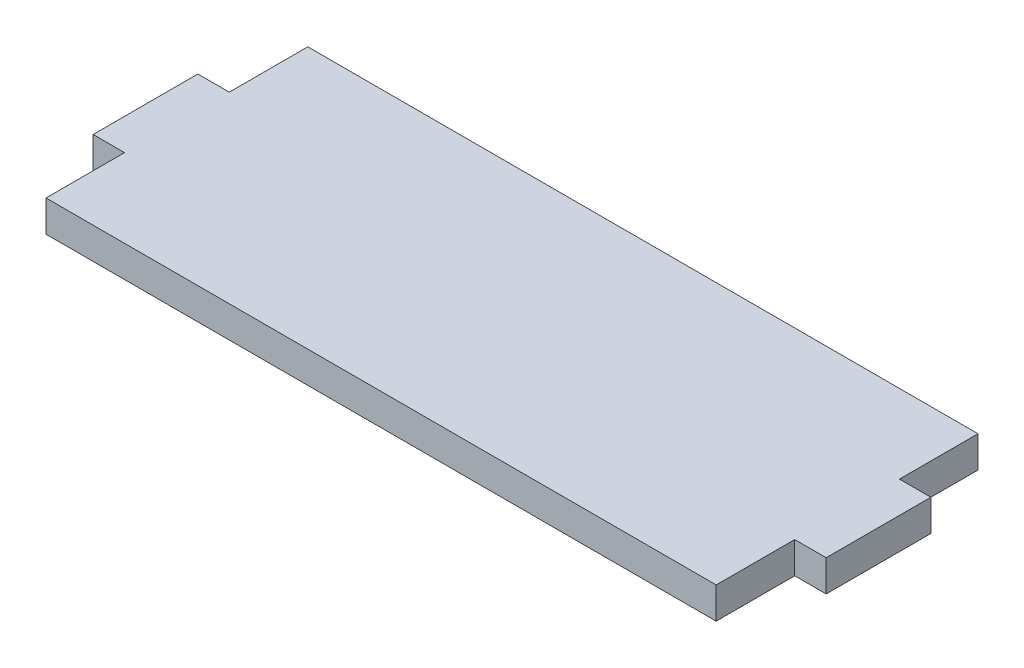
ISO-10303-21;
HEADER;
FILE_DESCRIPTION(('STEP AP214'),'2;1');
FILE_NAME('part.step','',(''),(''),'','','');
FILE_SCHEMA(('AUTOMOTIVE_DESIGN { 1 0 10303 214 1 1 1 1 }'));
ENDSEC;
DATA;
#1=APPLICATION_CONTEXT('core data for automotive mechanical design processes');
#2=APPLICATION_PROTOCOL_DEFINITION('international standard','automotive_design',2000,#1);
#3=PRODUCT_CONTEXT('',#1,'mechanical');
#4=PRODUCT('Part','Part','',(#3));
#5=PRODUCT_RELATED_PRODUCT_CATEGORY('part','',(#4));
#6=PRODUCT_DEFINITION_FORMATION('','',#4);
#7=PRODUCT_DEFINITION_CONTEXT('part definition',#1,'design');
#8=PRODUCT_DEFINITION('design','',#6,#7);
#9=PRODUCT_DEFINITION_SHAPE('','',#8);
#10=(LENGTH_UNIT() NAMED_UNIT(*) SI_UNIT(.MILLI.,.METRE.));
#11=(NAMED_UNIT(*) PLANE_ANGLE_UNIT() SI_UNIT($,.RADIAN.));
#12=(NAMED_UNIT(*) SI_UNIT($,.STERADIAN.) SOLID_ANGLE_UNIT());
#13=UNCERTAINTY_MEASURE_WITH_UNIT(LENGTH_MEASURE(1.E-05),#10,'distance_accuracy_value','');
#14=(GEOMETRIC_REPRESENTATION_CONTEXT(3) GLOBAL_UNCERTAINTY_ASSIGNED_CONTEXT((#13)) GLOBAL_UNIT_ASSIGNED_CONTEXT((#10,
#11,#12)) REPRESENTATION_CONTEXT('',''));
#15=CARTESIAN_POINT('',(0.,0.,0.));
#16=DIRECTION('',(0.,0.,1.));
#17=DIRECTION('',(1.,0.,0.));
#18=AXIS2_PLACEMENT_3D('',#15,#16,#17);
#19=CARTESIAN_POINT('',(28.1710459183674,3.,32.1948614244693));
#20=DIRECTION('',(-1.,0.,0.));
#21=DIRECTION('',(0.,0.,1.));
#22=AXIS2_PLACEMENT_3D('',#19,#20,#21);
#23=PLANE('',#22);
#24=DIRECTION('',(0.,0.,-1.));
#25=VECTOR('',#24,1.);
#26=CARTESIAN_POINT('',(28.1710459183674,0.,32.1948614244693));
#27=LINE('',#26,#25);
#28=CARTESIAN_POINT('',(28.1710459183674,0.,32.1948614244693));
#29=VERTEX_POINT('',#28);
#30=CARTESIAN_POINT('',(28.1710459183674,0.,24.6948614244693));
#31=VERTEX_POINT('',#30);
#32=EDGE_CURVE('E153',#29,#31,#27,.T.);
#33=ORIENTED_EDGE('',*,*,#32,.T.);
#34=DIRECTION('',(0.,-1.,0.));
#35=VECTOR('',#34,1.);
#36=CARTESIAN_POINT('',(28.1710459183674,3.,24.6948614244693));
#37=LINE('',#36,#35);
#38=CARTESIAN_POINT('',(28.1710459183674,3.,24.6948614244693));
#39=VERTEX_POINT('',#38);
#40=EDGE_CURVE('E11',#39,#31,#37,.T.);
#41=ORIENTED_EDGE('',*,*,#40,.F.);
#42=DIRECTION('',(0.,0.,-1.));
#43=VECTOR('',#42,1.);
#44=CARTESIAN_POINT('',(28.1710459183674,3.,32.1948614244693));
#45=LINE('',#44,#43);
#46=CARTESIAN_POINT('',(28.1710459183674,3.,32.1948614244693));
#47=VERTEX_POINT('',#46);
#48=EDGE_CURVE('E175',#47,#39,#45,.T.);
#49=ORIENTED_EDGE('',*,*,#48,.F.);
#50=DIRECTION('',(0.,-1.,0.));
#51=VECTOR('',#50,1.);
#52=CARTESIAN_POINT('',(28.1710459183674,3.,32.1948614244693));
#53=LINE('',#52,#51);
#54=EDGE_CURVE('E149',#47,#29,#53,.T.);
#55=ORIENTED_EDGE('',*,*,#54,.T.);
#56=EDGE_LOOP('',(#33,#41,#49,#55));
#57=FACE_BOUND('',#56,.T.);
#58=ADVANCED_FACE('F33',(#57),#23,.F.);
#59=CARTESIAN_POINT('',(31.1710459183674,3.,24.6948614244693));
#60=DIRECTION('',(0.,0.,-1.));
#61=DIRECTION('',(-1.,0.,0.));
#62=AXIS2_PLACEMENT_3D('',#59,#60,#61);
#63=PLANE('',#62);
#64=DIRECTION('',(1.,0.,0.));
#65=VECTOR('',#64,1.);
#66=CARTESIAN_POINT('',(31.1710459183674,0.,24.6948614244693));
#67=LINE('',#66,#65);
#68=CARTESIAN_POINT('',(31.1710459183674,0.,24.6948614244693));
#69=VERTEX_POINT('',#68);
#70=EDGE_CURVE('E156',#31,#69,#67,.T.);
#71=ORIENTED_EDGE('',*,*,#70,.T.);
#72=DIRECTION('',(0.,-1.,0.));
#73=VECTOR('',#72,1.);
#74=CARTESIAN_POINT('',(31.1710459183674,3.,24.6948614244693));
#75=LINE('',#74,#73);
#76=CARTESIAN_POINT('',(31.1710459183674,3.,24.6948614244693));
#77=VERTEX_POINT('',#76);
#78=EDGE_CURVE('E41',#77,#69,#75,.T.);
#79=ORIENTED_EDGE('',*,*,#78,.F.);
#80=DIRECTION('',(1.,0.,0.));
#81=VECTOR('',#80,1.);
#82=CARTESIAN_POINT('',(31.1710459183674,3.,24.6948614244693));
#83=LINE('',#82,#81);
#84=EDGE_CURVE('E104',#39,#77,#83,.T.);
#85=ORIENTED_EDGE('',*,*,#84,.F.);
#86=ORIENTED_EDGE('',*,*,#40,.T.);
#87=EDGE_LOOP('',(#71,#79,#85,#86));
#88=FACE_BOUND('',#87,.T.);
#89=ADVANCED_FACE('F253',(#88),#63,.F.);
#90=CARTESIAN_POINT('',(31.1710459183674,3.,14.6948614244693));
#91=DIRECTION('',(-1.,0.,0.));
#92=DIRECTION('',(0.,0.,1.));
#93=AXIS2_PLACEMENT_3D('',#90,#91,#92);
#94=PLANE('',#93);
#95=DIRECTION('',(0.,0.,-1.));
#96=VECTOR('',#95,1.);
#97=CARTESIAN_POINT('',(31.1710459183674,0.,14.6948614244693));
#98=LINE('',#97,#96);
#99=CARTESIAN_POINT('',(31.1710459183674,0.,14.6948614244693));
#100=VERTEX_POINT('',#99);
#101=EDGE_CURVE('E158',#69,#100,#98,.T.);
#102=ORIENTED_EDGE('',*,*,#101,.T.);
#103=DIRECTION('',(0.,-1.,0.));
#104=VECTOR('',#103,1.);
#105=CARTESIAN_POINT('',(31.1710459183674,3.,14.6948614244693));
#106=LINE('',#105,#104);
#107=CARTESIAN_POINT('',(31.1710459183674,3.,14.6948614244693));
#108=VERTEX_POINT('',#107);
#109=EDGE_CURVE('E194',#108,#100,#106,.T.);
#110=ORIENTED_EDGE('',*,*,#109,.F.);
#111=DIRECTION('',(0.,0.,-1.));
#112=VECTOR('',#111,1.);
#113=CARTESIAN_POINT('',(31.1710459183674,3.,14.6948614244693));
#114=LINE('',#113,#112);
#115=EDGE_CURVE('E202',#77,#108,#114,.T.);
#116=ORIENTED_EDGE('',*,*,#115,.F.);
#117=ORIENTED_EDGE('',*,*,#78,.T.);
#118=EDGE_LOOP('',(#102,#110,#116,#117));
#119=FACE_BOUND('',#118,.T.);
#120=ADVANCED_FACE('F200',(#119),#94,.F.);
#121=CARTESIAN_POINT('',(31.1710459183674,3.,14.6948614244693));
#122=DIRECTION('',(0.,0.,1.));
#123=DIRECTION('',(1.,0.,0.));
#124=AXIS2_PLACEMENT_3D('',#121,#122,#123);
#125=PLANE('',#124);
#126=DIRECTION('',(-1.,0.,0.));
#127=VECTOR('',#126,1.);
#128=CARTESIAN_POINT('',(31.1710459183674,0.,14.6948614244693));
#129=LINE('',#128,#127);
#130=CARTESIAN_POINT('',(28.1710459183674,0.,14.6948614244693));
#131=VERTEX_POINT('',#130);
#132=EDGE_CURVE('E160',#100,#131,#129,.T.);
#133=ORIENTED_EDGE('',*,*,#132,.T.);
#134=DIRECTION('',(0.,-1.,0.));
#135=VECTOR('',#134,1.);
#136=CARTESIAN_POINT('',(28.1710459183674,3.,14.6948614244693));
#137=LINE('',#136,#135);
#138=CARTESIAN_POINT('',(28.1710459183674,3.,14.6948614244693));
#139=VERTEX_POINT('',#138);
#140=EDGE_CURVE('E191',#139,#131,#137,.T.);
#141=ORIENTED_EDGE('',*,*,#140,.F.);
#142=DIRECTION('',(-1.,0.,0.));
#143=VECTOR('',#142,1.);
#144=CARTESIAN_POINT('',(31.1710459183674,3.,14.6948614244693));
#145=LINE('',#144,#143);
#146=EDGE_CURVE('E220',#108,#139,#145,.T.);
#147=ORIENTED_EDGE('',*,*,#146,.F.);
#148=ORIENTED_EDGE('',*,*,#109,.T.);
#149=EDGE_LOOP('',(#133,#141,#147,#148));
#150=FACE_BOUND('',#149,.T.);
#151=ADVANCED_FACE('F211',(#150),#125,.F.);
#152=CARTESIAN_POINT('',(28.1710459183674,3.,14.6948614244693));
#153=DIRECTION('',(-1.,0.,0.));
#154=DIRECTION('',(0.,0.,1.));
#155=AXIS2_PLACEMENT_3D('',#152,#153,#154);
#156=PLANE('',#155);
#157=DIRECTION('',(0.,0.,-1.));
#158=VECTOR('',#157,1.);
#159=CARTESIAN_POINT('',(28.1710459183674,0.,14.6948614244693));
#160=LINE('',#159,#158);
#161=CARTESIAN_POINT('',(28.1710459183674,0.,7.1948614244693));
#162=VERTEX_POINT('',#161);
#163=EDGE_CURVE('E162',#131,#162,#160,.T.);
#164=ORIENTED_EDGE('',*,*,#163,.T.);
#165=DIRECTION('',(0.,-1.,0.));
#166=VECTOR('',#165,1.);
#167=CARTESIAN_POINT('',(28.1710459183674,3.,7.1948614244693));
#168=LINE('',#167,#166);
#169=CARTESIAN_POINT('',(28.1710459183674,3.,7.1948614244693));
#170=VERTEX_POINT('',#169);
#171=EDGE_CURVE('E188',#170,#162,#168,.T.);
#172=ORIENTED_EDGE('',*,*,#171,.F.);
#173=DIRECTION('',(0.,0.,-1.));
#174=VECTOR('',#173,1.);
#175=CARTESIAN_POINT('',(28.1710459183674,3.,14.6948614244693));
#176=LINE('',#175,#174);
#177=EDGE_CURVE('E217',#139,#170,#176,.T.);
#178=ORIENTED_EDGE('',*,*,#177,.F.);
#179=ORIENTED_EDGE('',*,*,#140,.T.);
#180=EDGE_LOOP('',(#164,#172,#178,#179));
#181=FACE_BOUND('',#180,.T.);
#182=ADVANCED_FACE('F215',(#181),#156,.F.);
#183=CARTESIAN_POINT('',(-35.8289540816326,3.,7.1948614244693));
#184=DIRECTION('',(0.,0.,1.));
#185=DIRECTION('',(1.,0.,0.));
#186=AXIS2_PLACEMENT_3D('',#183,#184,#185);
#187=PLANE('',#186);
#188=DIRECTION('',(-1.,0.,0.));
#189=VECTOR('',#188,1.);
#190=CARTESIAN_POINT('',(-35.8289540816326,0.,7.1948614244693));
#191=LINE('',#190,#189);
#192=CARTESIAN_POINT('',(-35.8289540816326,0.,7.1948614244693));
#193=VERTEX_POINT('',#192);
#194=EDGE_CURVE('E164',#162,#193,#191,.T.);
#195=ORIENTED_EDGE('',*,*,#194,.T.);
#196=DIRECTION('',(0.,-1.,0.));
#197=VECTOR('',#196,1.);
#198=CARTESIAN_POINT('',(-35.8289540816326,3.,7.1948614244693));
#199=LINE('',#198,#197);
#200=CARTESIAN_POINT('',(-35.8289540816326,3.,7.1948614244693));
#201=VERTEX_POINT('',#200);
#202=EDGE_CURVE('E185',#201,#193,#199,.T.);
#203=ORIENTED_EDGE('',*,*,#202,.F.);
#204=DIRECTION('',(-1.,0.,0.));
#205=VECTOR('',#204,1.);
#206=CARTESIAN_POINT('',(-35.8289540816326,3.,7.1948614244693));
#207=LINE('',#206,#205);
#208=EDGE_CURVE('E219',#170,#201,#207,.T.);
#209=ORIENTED_EDGE('',*,*,#208,.F.);
#210=ORIENTED_EDGE('',*,*,#171,.T.);
#211=EDGE_LOOP('',(#195,#203,#209,#210));
#212=FACE_BOUND('',#211,.T.);
#213=ADVANCED_FACE('F266',(#212),#187,.F.);
#214=CARTESIAN_POINT('',(-35.8289540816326,3.,7.1948614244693));
#215=DIRECTION('',(1.,0.,0.));
#216=DIRECTION('',(0.,0.,-1.));
#217=AXIS2_PLACEMENT_3D('',#214,#215,#216);
#218=PLANE('',#217);
#219=DIRECTION('',(0.,0.,1.));
#220=VECTOR('',#219,1.);
#221=CARTESIAN_POINT('',(-35.8289540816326,0.,7.1948614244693));
#222=LINE('',#221,#220);
#223=CARTESIAN_POINT('',(-35.8289540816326,0.,14.6948614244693));
#224=VERTEX_POINT('',#223);
#225=EDGE_CURVE('E166',#193,#224,#222,.T.);
#226=ORIENTED_EDGE('',*,*,#225,.T.);
#227=DIRECTION('',(0.,-1.,0.));
#228=VECTOR('',#227,1.);
#229=CARTESIAN_POINT('',(-35.8289540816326,3.,14.6948614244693));
#230=LINE('',#229,#228);
#231=CARTESIAN_POINT('',(-35.8289540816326,3.,14.6948614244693));
#232=VERTEX_POINT('',#231);
#233=EDGE_CURVE('E182',#232,#224,#230,.T.);
#234=ORIENTED_EDGE('',*,*,#233,.F.);
#235=DIRECTION('',(0.,0.,1.));
#236=VECTOR('',#235,1.);
#237=CARTESIAN_POINT('',(-35.8289540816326,3.,7.1948614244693));
#238=LINE('',#237,#236);
#239=EDGE_CURVE('E222',#201,#232,#238,.T.);
#240=ORIENTED_EDGE('',*,*,#239,.F.);
#241=ORIENTED_EDGE('',*,*,#202,.T.);
#242=EDGE_LOOP('',(#226,#234,#240,#241));
#243=FACE_BOUND('',#242,.T.);
#244=ADVANCED_FACE('F269',(#243),#218,.F.);
#245=CARTESIAN_POINT('',(-35.8289540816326,3.,14.6948614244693));
#246=DIRECTION('',(0.,0.,1.));
#247=DIRECTION('',(1.,0.,0.));
#248=AXIS2_PLACEMENT_3D('',#245,#246,#247);
#249=PLANE('',#248);
#250=DIRECTION('',(-1.,0.,0.));
#251=VECTOR('',#250,1.);
#252=CARTESIAN_POINT('',(-35.8289540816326,0.,14.6948614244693));
#253=LINE('',#252,#251);
#254=CARTESIAN_POINT('',(-38.8289540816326,0.,14.6948614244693));
#255=VERTEX_POINT('',#254);
#256=EDGE_CURVE('E168',#224,#255,#253,.T.);
#257=ORIENTED_EDGE('',*,*,#256,.T.);
#258=DIRECTION('',(0.,-1.,0.));
#259=VECTOR('',#258,1.);
#260=CARTESIAN_POINT('',(-38.8289540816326,3.,14.6948614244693));
#261=LINE('',#260,#259);
#262=CARTESIAN_POINT('',(-38.8289540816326,3.,14.6948614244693));
#263=VERTEX_POINT('',#262);
#264=EDGE_CURVE('E179',#263,#255,#261,.T.);
#265=ORIENTED_EDGE('',*,*,#264,.F.);
#266=DIRECTION('',(-1.,0.,0.));
#267=VECTOR('',#266,1.);
#268=CARTESIAN_POINT('',(-35.8289540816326,3.,14.6948614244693));
#269=LINE('',#268,#267);
#270=EDGE_CURVE('E228',#232,#263,#269,.T.);
#271=ORIENTED_EDGE('',*,*,#270,.F.);
#272=ORIENTED_EDGE('',*,*,#233,.T.);
#273=EDGE_LOOP('',(#257,#265,#271,#272));
#274=FACE_BOUND('',#273,.T.);
#275=ADVANCED_FACE('F234',(#274),#249,.F.);
#276=CARTESIAN_POINT('',(-38.8289540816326,3.,14.6948614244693));
#277=DIRECTION('',(1.,0.,0.));
#278=DIRECTION('',(0.,0.,-1.));
#279=AXIS2_PLACEMENT_3D('',#276,#277,#278);
#280=PLANE('',#279);
#281=DIRECTION('',(0.,0.,1.));
#282=VECTOR('',#281,1.);
#283=CARTESIAN_POINT('',(-38.8289540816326,0.,14.6948614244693));
#284=LINE('',#283,#282);
#285=CARTESIAN_POINT('',(-38.8289540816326,0.,24.6948614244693));
#286=VERTEX_POINT('',#285);
#287=EDGE_CURVE('E170',#255,#286,#284,.T.);
#288=ORIENTED_EDGE('',*,*,#287,.T.);
#289=DIRECTION('',(0.,-1.,0.));
#290=VECTOR('',#289,1.);
#291=CARTESIAN_POINT('',(-38.8289540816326,3.,24.6948614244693));
#292=LINE('',#291,#290);
#293=CARTESIAN_POINT('',(-38.8289540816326,3.,24.6948614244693));
#294=VERTEX_POINT('',#293);
#295=EDGE_CURVE('E144',#294,#286,#292,.T.);
#296=ORIENTED_EDGE('',*,*,#295,.F.);
#297=DIRECTION('',(0.,0.,1.));
#298=VECTOR('',#297,1.);
#299=CARTESIAN_POINT('',(-38.8289540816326,3.,14.6948614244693));
#300=LINE('',#299,#298);
#301=EDGE_CURVE('E135',#263,#294,#300,.T.);
#302=ORIENTED_EDGE('',*,*,#301,.F.);
#303=ORIENTED_EDGE('',*,*,#264,.T.);
#304=EDGE_LOOP('',(#288,#296,#302,#303));
#305=FACE_BOUND('',#304,.T.);
#306=ADVANCED_FACE('F238',(#305),#280,.F.);
#307=CARTESIAN_POINT('',(-35.8289540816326,3.,24.6948614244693));
#308=DIRECTION('',(0.,0.,-1.));
#309=DIRECTION('',(-1.,0.,0.));
#310=AXIS2_PLACEMENT_3D('',#307,#308,#309);
#311=PLANE('',#310);
#312=DIRECTION('',(1.,0.,0.));
#313=VECTOR('',#312,1.);
#314=CARTESIAN_POINT('',(-35.8289540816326,0.,24.6948614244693));
#315=LINE('',#314,#313);
#316=CARTESIAN_POINT('',(-35.8289540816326,0.,24.6948614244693));
#317=VERTEX_POINT('',#316);
#318=EDGE_CURVE('E143',#286,#317,#315,.T.);
#319=ORIENTED_EDGE('',*,*,#318,.T.);
#320=DIRECTION('',(0.,-1.,0.));
#321=VECTOR('',#320,1.);
#322=CARTESIAN_POINT('',(-35.8289540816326,3.,24.6948614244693));
#323=LINE('',#322,#321);
#324=CARTESIAN_POINT('',(-35.8289540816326,3.,24.6948614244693));
#325=VERTEX_POINT('',#324);
#326=EDGE_CURVE('E140',#325,#317,#323,.T.);
#327=ORIENTED_EDGE('',*,*,#326,.F.);
#328=DIRECTION('',(1.,0.,0.));
#329=VECTOR('',#328,1.);
#330=CARTESIAN_POINT('',(-35.8289540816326,3.,24.6948614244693));
#331=LINE('',#330,#329);
#332=EDGE_CURVE('E129',#294,#325,#331,.T.);
#333=ORIENTED_EDGE('',*,*,#332,.F.);
#334=ORIENTED_EDGE('',*,*,#295,.T.);
#335=EDGE_LOOP('',(#319,#327,#333,#334));
#336=FACE_BOUND('',#335,.T.);
#337=ADVANCED_FACE('F141',(#336),#311,.F.);
#338=CARTESIAN_POINT('',(-35.8289540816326,3.,24.6948614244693));
#339=DIRECTION('',(1.,0.,0.));
#340=DIRECTION('',(0.,0.,-1.));
#341=AXIS2_PLACEMENT_3D('',#338,#339,#340);
#342=PLANE('',#341);
#343=DIRECTION('',(0.,0.,1.));
#344=VECTOR('',#343,1.);
#345=CARTESIAN_POINT('',(-35.8289540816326,0.,24.6948614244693));
#346=LINE('',#345,#344);
#347=CARTESIAN_POINT('',(-35.8289540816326,0.,32.1948614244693));
#348=VERTEX_POINT('',#347);
#349=EDGE_CURVE('E90',#317,#348,#346,.T.);
#350=ORIENTED_EDGE('',*,*,#349,.T.);
#351=DIRECTION('',(0.,-1.,0.));
#352=VECTOR('',#351,1.);
#353=CARTESIAN_POINT('',(-35.8289540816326,3.,32.1948614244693));
#354=LINE('',#353,#352);
#355=CARTESIAN_POINT('',(-35.8289540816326,3.,32.1948614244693));
#356=VERTEX_POINT('',#355);
#357=EDGE_CURVE('E145',#356,#348,#354,.T.);
#358=ORIENTED_EDGE('',*,*,#357,.F.);
#359=DIRECTION('',(0.,0.,1.));
#360=VECTOR('',#359,1.);
#361=CARTESIAN_POINT('',(-35.8289540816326,3.,24.6948614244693));
#362=LINE('',#361,#360);
#363=EDGE_CURVE('E133',#325,#356,#362,.T.);
#364=ORIENTED_EDGE('',*,*,#363,.F.);
#365=ORIENTED_EDGE('',*,*,#326,.T.);
#366=EDGE_LOOP('',(#350,#358,#364,#365));
#367=FACE_BOUND('',#366,.T.);
#368=ADVANCED_FACE('F147',(#367),#342,.F.);
#369=CARTESIAN_POINT('',(-35.8289540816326,3.,32.1948614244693));
#370=DIRECTION('',(0.,0.,-1.));
#371=DIRECTION('',(-1.,0.,0.));
#372=AXIS2_PLACEMENT_3D('',#369,#370,#371);
#373=PLANE('',#372);
#374=DIRECTION('',(1.,0.,0.));
#375=VECTOR('',#374,1.);
#376=CARTESIAN_POINT('',(-35.8289540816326,0.,32.1948614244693));
#377=LINE('',#376,#375);
#378=EDGE_CURVE('E96',#348,#29,#377,.T.);
#379=ORIENTED_EDGE('',*,*,#378,.T.);
#380=ORIENTED_EDGE('',*,*,#54,.F.);
#381=DIRECTION('',(1.,0.,0.));
#382=VECTOR('',#381,1.);
#383=CARTESIAN_POINT('',(-35.8289540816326,3.,32.1948614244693));
#384=LINE('',#383,#382);
#385=EDGE_CURVE('E49',#356,#47,#384,.T.);
#386=ORIENTED_EDGE('',*,*,#385,.F.);
#387=ORIENTED_EDGE('',*,*,#357,.T.);
#388=EDGE_LOOP('',(#379,#380,#386,#387));
#389=FACE_BOUND('',#388,.T.);
#390=ADVANCED_FACE('F242',(#389),#373,.F.);
#391=CARTESIAN_POINT('',(28.1710459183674,3.,24.6948614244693));
#392=DIRECTION('',(0.,1.,0.));
#393=DIRECTION('',(0.,0.,1.));
#394=AXIS2_PLACEMENT_3D('',#391,#392,#393);
#395=PLANE('',#394);
#396=ORIENTED_EDGE('',*,*,#48,.T.);
#397=ORIENTED_EDGE('',*,*,#84,.T.);
#398=ORIENTED_EDGE('',*,*,#115,.T.);
#399=ORIENTED_EDGE('',*,*,#146,.T.);
#400=ORIENTED_EDGE('',*,*,#177,.T.);
#401=ORIENTED_EDGE('',*,*,#208,.T.);
#402=ORIENTED_EDGE('',*,*,#239,.T.);
#403=ORIENTED_EDGE('',*,*,#270,.T.);
#404=ORIENTED_EDGE('',*,*,#301,.T.);
#405=ORIENTED_EDGE('',*,*,#332,.T.);
#406=ORIENTED_EDGE('',*,*,#363,.T.);
#407=ORIENTED_EDGE('',*,*,#385,.T.);
#408=EDGE_LOOP('',(#396,#397,#398,#399,#400,#401,#402,#403,#404,#405,#406,#407));
#409=FACE_BOUND('',#408,.T.);
#410=ADVANCED_FACE('F131',(#409),#395,.T.);
#411=CARTESIAN_POINT('',(28.1710459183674,0.,24.6948614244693));
#412=DIRECTION('',(0.,1.,0.));
#413=DIRECTION('',(0.,0.,1.));
#414=AXIS2_PLACEMENT_3D('',#411,#412,#413);
#415=PLANE('',#414);
#416=ORIENTED_EDGE('',*,*,#32,.F.);
#417=ORIENTED_EDGE('',*,*,#378,.F.);
#418=ORIENTED_EDGE('',*,*,#349,.F.);
#419=ORIENTED_EDGE('',*,*,#318,.F.);
#420=ORIENTED_EDGE('',*,*,#287,.F.);
#421=ORIENTED_EDGE('',*,*,#256,.F.);
#422=ORIENTED_EDGE('',*,*,#225,.F.);
#423=ORIENTED_EDGE('',*,*,#194,.F.);
#424=ORIENTED_EDGE('',*,*,#163,.F.);
#425=ORIENTED_EDGE('',*,*,#132,.F.);
#426=ORIENTED_EDGE('',*,*,#101,.F.);
#427=ORIENTED_EDGE('',*,*,#70,.F.);
#428=EDGE_LOOP('',(#416,#417,#418,#419,#420,#421,#422,#423,#424,#425,#426,#427));
#429=FACE_BOUND('',#428,.T.);
#430=ADVANCED_FACE('F206',(#429),#415,.F.);
#431=CLOSED_SHELL('',(#58,#89,#120,#151,#182,#213,#244,#275,#306,#337,#368,#390,#410,#430));
#432=MANIFOLD_SOLID_BREP('B2',#431);
#433=ADVANCED_BREP_SHAPE_REPRESENTATION('',(#18,#432),#14);
#434=SHAPE_DEFINITION_REPRESENTATION(#9,#433);
ENDSEC;
END-ISO-10303-21;
